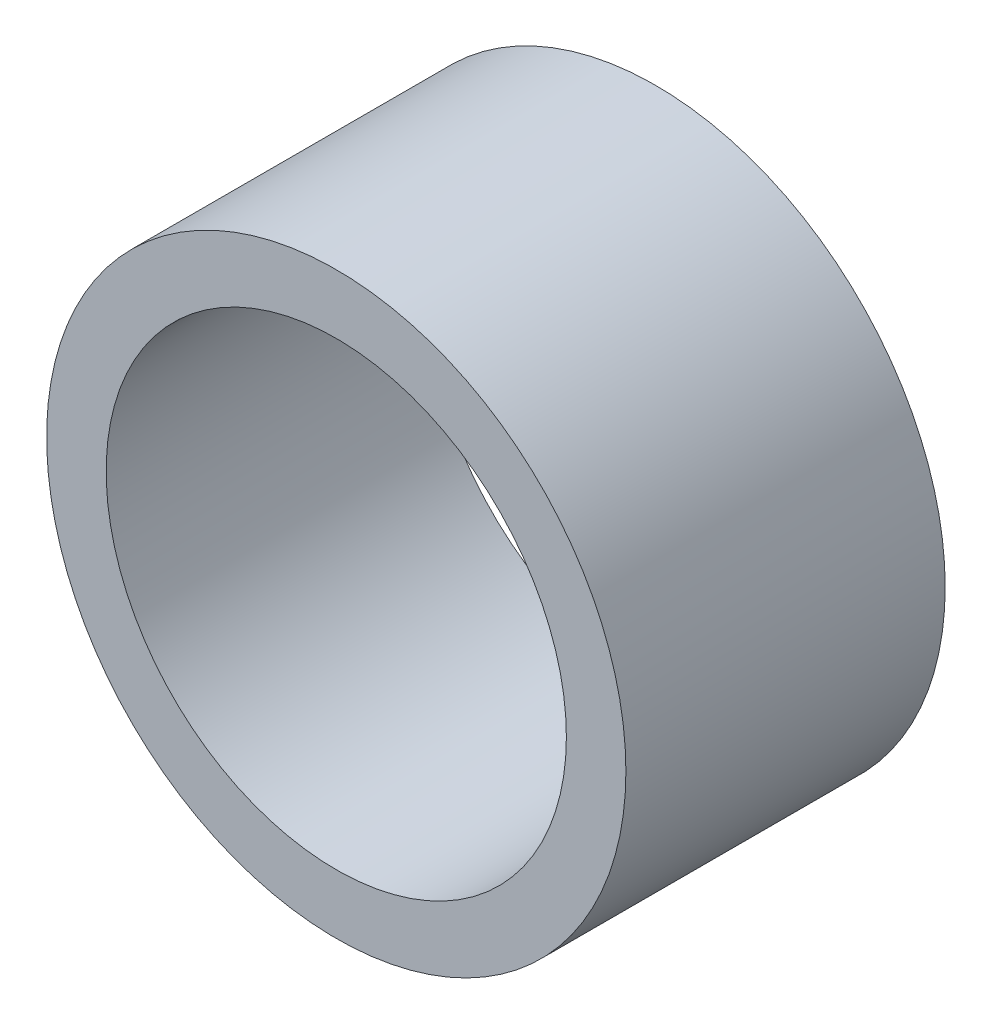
ISO-10303-21;
HEADER;
FILE_DESCRIPTION(('STEP AP214'),'2;1');
FILE_NAME('part.step','',(''),(''),'','','');
FILE_SCHEMA(('AUTOMOTIVE_DESIGN { 1 0 10303 214 1 1 1 1 }'));
ENDSEC;
DATA;
#1=APPLICATION_CONTEXT('core data for automotive mechanical design processes');
#2=APPLICATION_PROTOCOL_DEFINITION('international standard','automotive_design',2000,#1);
#3=PRODUCT_CONTEXT('',#1,'mechanical');
#4=PRODUCT('Part','Part','',(#3));
#5=PRODUCT_RELATED_PRODUCT_CATEGORY('part','',(#4));
#6=PRODUCT_DEFINITION_FORMATION('','',#4);
#7=PRODUCT_DEFINITION_CONTEXT('part definition',#1,'design');
#8=PRODUCT_DEFINITION('design','',#6,#7);
#9=PRODUCT_DEFINITION_SHAPE('','',#8);
#10=(LENGTH_UNIT() NAMED_UNIT(*) SI_UNIT(.MILLI.,.METRE.));
#11=(NAMED_UNIT(*) PLANE_ANGLE_UNIT() SI_UNIT($,.RADIAN.));
#12=(NAMED_UNIT(*) SI_UNIT($,.STERADIAN.) SOLID_ANGLE_UNIT());
#13=UNCERTAINTY_MEASURE_WITH_UNIT(LENGTH_MEASURE(1.E-05),#10,'distance_accuracy_value','');
#14=(GEOMETRIC_REPRESENTATION_CONTEXT(3) GLOBAL_UNCERTAINTY_ASSIGNED_CONTEXT((#13)) GLOBAL_UNIT_ASSIGNED_CONTEXT((#10,
#11,#12)) REPRESENTATION_CONTEXT('',''));
#15=CARTESIAN_POINT('',(0.,0.,0.));
#16=DIRECTION('',(0.,0.,1.));
#17=DIRECTION('',(1.,0.,0.));
#18=AXIS2_PLACEMENT_3D('',#15,#16,#17);
#19=CARTESIAN_POINT('',(0.,0.,-7.));
#20=DIRECTION('',(0.,0.,1.));
#21=DIRECTION('',(1.,0.,0.));
#22=AXIS2_PLACEMENT_3D('',#19,#20,#21);
#23=CYLINDRICAL_SURFACE('',#22,6.35);
#24=CARTESIAN_POINT('',(0.,0.,-7.));
#25=DIRECTION('',(0.,0.,1.));
#26=DIRECTION('',(1.,0.,0.));
#27=AXIS2_PLACEMENT_3D('',#24,#25,#26);
#28=CIRCLE('',#27,6.35);
#29=CARTESIAN_POINT('',(6.35,0.,-7.));
#30=VERTEX_POINT('',#29);
#31=EDGE_CURVE('E10',#30,#30,#28,.T.);
#32=ORIENTED_EDGE('',*,*,#31,.T.);
#33=EDGE_LOOP('',(#32));
#34=FACE_BOUND('',#33,.T.);
#35=CARTESIAN_POINT('',(0.,0.,0.));
#36=DIRECTION('',(0.,0.,1.));
#37=DIRECTION('',(1.,0.,0.));
#38=AXIS2_PLACEMENT_3D('',#35,#36,#37);
#39=CIRCLE('',#38,6.35);
#40=CARTESIAN_POINT('',(6.35,0.,0.));
#41=VERTEX_POINT('',#40);
#42=EDGE_CURVE('E33',#41,#41,#39,.T.);
#43=ORIENTED_EDGE('',*,*,#42,.F.);
#44=EDGE_LOOP('',(#43));
#45=FACE_BOUND('',#44,.T.);
#46=ADVANCED_FACE('F30',(#34,#45),#23,.T.);
#47=CARTESIAN_POINT('',(0.,0.,-7.));
#48=DIRECTION('',(0.,0.,1.));
#49=DIRECTION('',(1.,0.,0.));
#50=AXIS2_PLACEMENT_3D('',#47,#48,#49);
#51=PLANE('',#50);
#52=CARTESIAN_POINT('',(0.,0.,-7.));
#53=DIRECTION('',(0.,0.,1.));
#54=DIRECTION('',(1.,0.,0.));
#55=AXIS2_PLACEMENT_3D('',#52,#53,#54);
#56=CIRCLE('',#55,5.045);
#57=CARTESIAN_POINT('',(5.045,0.,-7.));
#58=VERTEX_POINT('',#57);
#59=EDGE_CURVE('E40',#58,#58,#56,.T.);
#60=ORIENTED_EDGE('',*,*,#59,.T.);
#61=EDGE_LOOP('',(#60));
#62=FACE_BOUND('',#61,.T.);
#63=ORIENTED_EDGE('',*,*,#31,.F.);
#64=EDGE_LOOP('',(#63));
#65=FACE_BOUND('',#64,.T.);
#66=ADVANCED_FACE('F48',(#62,#65),#51,.F.);
#67=CARTESIAN_POINT('',(0.,0.,0.));
#68=DIRECTION('',(0.,0.,1.));
#69=DIRECTION('',(1.,0.,0.));
#70=AXIS2_PLACEMENT_3D('',#67,#68,#69);
#71=PLANE('',#70);
#72=CARTESIAN_POINT('',(0.,0.,0.));
#73=DIRECTION('',(0.,0.,1.));
#74=DIRECTION('',(1.,0.,0.));
#75=AXIS2_PLACEMENT_3D('',#72,#73,#74);
#76=CIRCLE('',#75,5.045);
#77=CARTESIAN_POINT('',(5.045,0.,0.));
#78=VERTEX_POINT('',#77);
#79=EDGE_CURVE('E42',#78,#78,#76,.T.);
#80=ORIENTED_EDGE('',*,*,#79,.F.);
#81=EDGE_LOOP('',(#80));
#82=FACE_BOUND('',#81,.T.);
#83=ORIENTED_EDGE('',*,*,#42,.T.);
#84=EDGE_LOOP('',(#83));
#85=FACE_BOUND('',#84,.T.);
#86=ADVANCED_FACE('F54',(#82,#85),#71,.T.);
#87=CARTESIAN_POINT('',(0.,0.,-7.));
#88=DIRECTION('',(0.,0.,1.));
#89=DIRECTION('',(1.,0.,0.));
#90=AXIS2_PLACEMENT_3D('',#87,#88,#89);
#91=CYLINDRICAL_SURFACE('',#90,5.045);
#92=ORIENTED_EDGE('',*,*,#59,.F.);
#93=EDGE_LOOP('',(#92));
#94=FACE_BOUND('',#93,.T.);
#95=ORIENTED_EDGE('',*,*,#79,.T.);
#96=EDGE_LOOP('',(#95));
#97=FACE_BOUND('',#96,.T.);
#98=ADVANCED_FACE('F51',(#94,#97),#91,.F.);
#99=CLOSED_SHELL('',(#46,#66,#86,#98));
#100=MANIFOLD_SOLID_BREP('B2',#99);
#101=ADVANCED_BREP_SHAPE_REPRESENTATION('',(#18,#100),#14);
#102=SHAPE_DEFINITION_REPRESENTATION(#9,#101);
ENDSEC;
END-ISO-10303-21;
